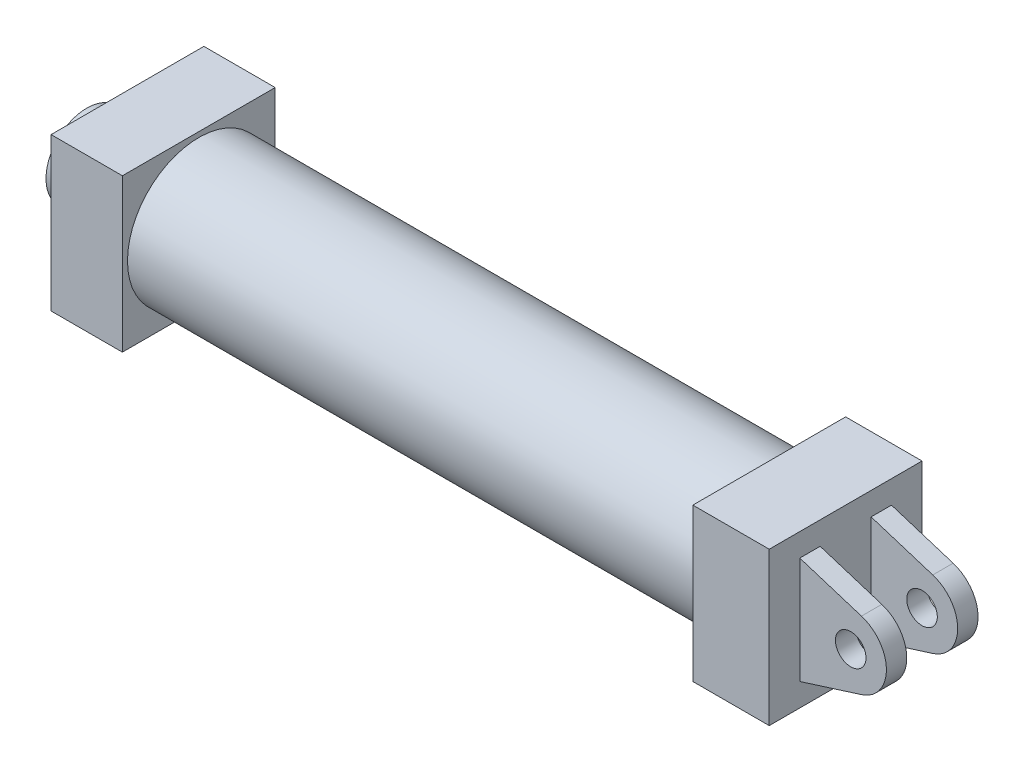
from build123d import *

# Parameters (mm, degrees)
SKETCH1_W           = 95.25
SKETCH1_H           = 95.25
BASE_EXTRUDE_DEPTH  = 47.625
SKETCH2_R           = 44.45
BOSS_EXTRUDE1_DEPTH = 355.6
SKETCH3_W           = 95.25
SKETCH3_H           = 95.25
BOSS_EXTRUDE2_DEPTH = 44.45
SKETCH4_R           = 25.4
BOSS_EXTRUDE3_DEPTH = 25.4
CUT_EXTRUDE1_START  = -425.45
SKETCH5_R           = 17.4625
CUT_EXTRUDE1_DEPTH  = 425.45
SKETCH6_R           = 9.525
BOSS_EXTRUDE4_DEPTH = 28.575
SKETCH7_W           = 53.975
SKETCH7_H           = 31.75
CUT_EXTRUDE2_DEPTH  = 485.913042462


with BuildPart() as part:
    # Sketch1 → Base-Extrude (new body)
    with BuildSketch(Plane(origin=(0, 0, 0), x_dir=(0, 0, -1), z_dir=(1, 0, 0))):
        Rectangle(SKETCH1_W, SKETCH1_H)
    extrude(amount=-BASE_EXTRUDE_DEPTH)

    # Sketch2 → Boss-Extrude1 (add)
    with BuildSketch(Plane.ZY.offset(47.625)):
        Circle(SKETCH2_R)
    extrude(amount=BOSS_EXTRUDE1_DEPTH)

    # Sketch3 → Boss-Extrude2 (add)
    with BuildSketch(Plane.ZY.offset(403.225)):
        Rectangle(SKETCH3_W, SKETCH3_H)
    extrude(amount=BOSS_EXTRUDE2_DEPTH)

    # Sketch4 → Boss-Extrude3 (add)
    with BuildSketch(Plane.ZY.offset(447.675)):
        Circle(SKETCH4_R)
    extrude(amount=BOSS_EXTRUDE3_DEPTH)

    # Sketch5 → Cut-Extrude1 (cut)
    with BuildSketch(Plane.ZY.offset(473.075).offset(CUT_EXTRUDE1_START)):
        Circle(SKETCH5_R)
    extrude(amount=CUT_EXTRUDE1_DEPTH, mode=Mode.SUBTRACT)

    # Sketch6 → Boss-Extrude4 (add, symmetric)
    with BuildSketch(Plane.XY):
        with BuildLine():
            Line((38.433186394, 21.19635923), (0, 33.314296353))
            Line((0, 33.314296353), (0, -33.314296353))
            Line((0, -33.314296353), (38.433186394, -21.19635923))
            ThreePointArc((38.433186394, -21.19635923), (53.975, 0), (38.433186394, 21.19635923))
        make_face()
        with Locations((31.75, 0)):
            Circle(SKETCH6_R, mode=Mode.SUBTRACT)
    extrude(amount=BOSS_EXTRUDE4_DEPTH, both=True)

    # Sketch7 → Cut-Extrude2 (cut, through all)
    with BuildSketch(Plane(origin=(0, 47.625, 0), x_dir=(-1, 0, 0), z_dir=(0, 1, 0))):
        with Locations((-26.9875, 0)):
            Rectangle(SKETCH7_W, SKETCH7_H)
    extrude(amount=-CUT_EXTRUDE2_DEPTH, mode=Mode.SUBTRACT)


solid = part.part
